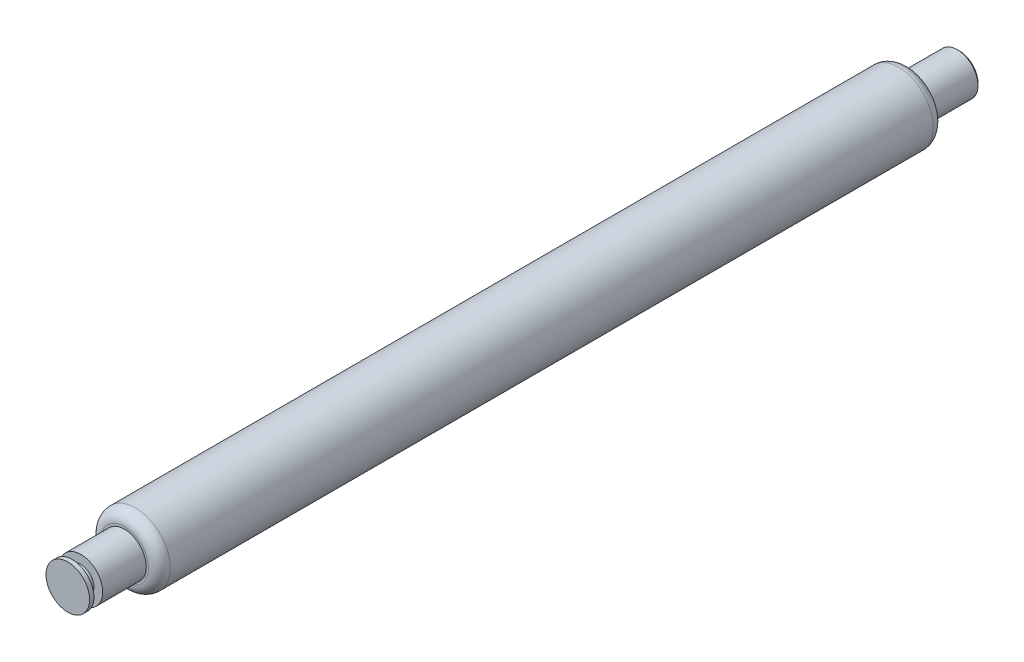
ISO-10303-21;
HEADER;
FILE_DESCRIPTION(('STEP AP214'),'2;1');
FILE_NAME('part.step','',(''),(''),'','','');
FILE_SCHEMA(('AUTOMOTIVE_DESIGN { 1 0 10303 214 1 1 1 1 }'));
ENDSEC;
DATA;
#1=APPLICATION_CONTEXT('core data for automotive mechanical design processes');
#2=APPLICATION_PROTOCOL_DEFINITION('international standard','automotive_design',2000,#1);
#3=PRODUCT_CONTEXT('',#1,'mechanical');
#4=PRODUCT('Part','Part','',(#3));
#5=PRODUCT_RELATED_PRODUCT_CATEGORY('part','',(#4));
#6=PRODUCT_DEFINITION_FORMATION('','',#4);
#7=PRODUCT_DEFINITION_CONTEXT('part definition',#1,'design');
#8=PRODUCT_DEFINITION('design','',#6,#7);
#9=PRODUCT_DEFINITION_SHAPE('','',#8);
#10=(LENGTH_UNIT() NAMED_UNIT(*) SI_UNIT(.MILLI.,.METRE.));
#11=(NAMED_UNIT(*) PLANE_ANGLE_UNIT() SI_UNIT($,.RADIAN.));
#12=(NAMED_UNIT(*) SI_UNIT($,.STERADIAN.) SOLID_ANGLE_UNIT());
#13=UNCERTAINTY_MEASURE_WITH_UNIT(LENGTH_MEASURE(1.E-05),#10,'distance_accuracy_value','');
#14=(GEOMETRIC_REPRESENTATION_CONTEXT(3) GLOBAL_UNCERTAINTY_ASSIGNED_CONTEXT((#13)) GLOBAL_UNIT_ASSIGNED_CONTEXT((#10,
#11,#12)) REPRESENTATION_CONTEXT('',''));
#15=CARTESIAN_POINT('',(0.,0.,0.));
#16=DIRECTION('',(0.,0.,1.));
#17=DIRECTION('',(1.,0.,0.));
#18=AXIS2_PLACEMENT_3D('',#15,#16,#17);
#19=CARTESIAN_POINT('',(0.,0.,180.));
#20=DIRECTION('',(0.,0.,-1.));
#21=DIRECTION('',(-1.,0.,0.));
#22=AXIS2_PLACEMENT_3D('',#19,#20,#21);
#23=CYLINDRICAL_SURFACE('',#22,8.);
#24=CARTESIAN_POINT('',(0.,0.,2.49999999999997));
#25=DIRECTION('',(0.,0.,1.));
#26=DIRECTION('',(1.,0.,0.));
#27=AXIS2_PLACEMENT_3D('',#24,#25,#26);
#28=CIRCLE('',#27,8.);
#29=CARTESIAN_POINT('',(-8.,0.,2.49999999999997));
#30=VERTEX_POINT('',#29);
#31=EDGE_CURVE('E60',#30,#30,#28,.T.);
#32=CARTESIAN_POINT('',(0.,0.,177.5));
#33=DIRECTION('',(0.,0.,1.));
#34=DIRECTION('',(1.,0.,0.));
#35=AXIS2_PLACEMENT_3D('',#32,#33,#34);
#36=CIRCLE('',#35,8.);
#37=CARTESIAN_POINT('',(-8.,0.,177.5));
#38=VERTEX_POINT('',#37);
#39=EDGE_CURVE('E63',#38,#38,#36,.F.);
#40=CARTESIAN_POINT('',(-8.,0.,2.49999999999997));
#41=CARTESIAN_POINT('',(-8.,0.,4.32291666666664));
#42=CARTESIAN_POINT('',(-8.,0.,6.14583333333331));
#43=CARTESIAN_POINT('',(-8.,0.,9.79166666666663));
#44=CARTESIAN_POINT('',(-8.,0.,11.6145833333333));
#45=CARTESIAN_POINT('',(-8.,0.,15.2604166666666));
#46=CARTESIAN_POINT('',(-8.,0.,17.0833333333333));
#47=CARTESIAN_POINT('',(-8.,0.,20.7291666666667));
#48=CARTESIAN_POINT('',(-8.,0.,22.5520833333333));
#49=CARTESIAN_POINT('',(-8.,0.,26.1979166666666));
#50=CARTESIAN_POINT('',(-8.,0.,28.0208333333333));
#51=CARTESIAN_POINT('',(-8.,0.,31.6666666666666));
#52=CARTESIAN_POINT('',(-8.,0.,33.4895833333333));
#53=CARTESIAN_POINT('',(-8.,0.,37.1354166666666));
#54=CARTESIAN_POINT('',(-8.,0.,38.9583333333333));
#55=CARTESIAN_POINT('',(-8.,0.,42.6041666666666));
#56=CARTESIAN_POINT('',(-8.,0.,44.4270833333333));
#57=CARTESIAN_POINT('',(-8.,0.,48.0729166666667));
#58=CARTESIAN_POINT('',(-8.,0.,49.8958333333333));
#59=CARTESIAN_POINT('',(-8.,0.,53.5416666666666));
#60=CARTESIAN_POINT('',(-8.,0.,55.3645833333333));
#61=CARTESIAN_POINT('',(-8.,0.,59.0104166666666));
#62=CARTESIAN_POINT('',(-8.,0.,60.8333333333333));
#63=CARTESIAN_POINT('',(-8.,0.,64.4791666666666));
#64=CARTESIAN_POINT('',(-8.,0.,66.3020833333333));
#65=CARTESIAN_POINT('',(-8.,0.,69.9479166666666));
#66=CARTESIAN_POINT('',(-8.,0.,71.7708333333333));
#67=CARTESIAN_POINT('',(-8.,0.,75.4166666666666));
#68=CARTESIAN_POINT('',(-8.,0.,77.2395833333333));
#69=CARTESIAN_POINT('',(-8.,0.,80.8854166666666));
#70=CARTESIAN_POINT('',(-8.,0.,82.7083333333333));
#71=CARTESIAN_POINT('',(-8.,0.,86.3541666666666));
#72=CARTESIAN_POINT('',(-8.,0.,88.1770833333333));
#73=CARTESIAN_POINT('',(-8.,0.,91.8229166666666));
#74=CARTESIAN_POINT('',(-8.,0.,93.6458333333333));
#75=CARTESIAN_POINT('',(-8.,0.,97.2916666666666));
#76=CARTESIAN_POINT('',(-8.,0.,99.1145833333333));
#77=CARTESIAN_POINT('',(-8.,0.,102.760416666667));
#78=CARTESIAN_POINT('',(-8.,0.,104.583333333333));
#79=CARTESIAN_POINT('',(-8.,0.,108.229166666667));
#80=CARTESIAN_POINT('',(-8.,0.,110.052083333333));
#81=CARTESIAN_POINT('',(-8.,0.,113.697916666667));
#82=CARTESIAN_POINT('',(-8.,0.,115.520833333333));
#83=CARTESIAN_POINT('',(-8.,0.,119.166666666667));
#84=CARTESIAN_POINT('',(-8.,0.,120.989583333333));
#85=CARTESIAN_POINT('',(-8.,0.,124.635416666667));
#86=CARTESIAN_POINT('',(-8.,0.,126.458333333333));
#87=CARTESIAN_POINT('',(-8.,0.,130.104166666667));
#88=CARTESIAN_POINT('',(-8.,0.,131.927083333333));
#89=CARTESIAN_POINT('',(-8.,0.,135.572916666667));
#90=CARTESIAN_POINT('',(-8.,0.,137.395833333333));
#91=CARTESIAN_POINT('',(-8.,0.,141.041666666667));
#92=CARTESIAN_POINT('',(-8.,0.,142.864583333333));
#93=CARTESIAN_POINT('',(-8.,0.,146.510416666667));
#94=CARTESIAN_POINT('',(-8.,0.,148.333333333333));
#95=CARTESIAN_POINT('',(-8.,0.,151.979166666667));
#96=CARTESIAN_POINT('',(-8.,0.,153.802083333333));
#97=CARTESIAN_POINT('',(-8.,0.,157.447916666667));
#98=CARTESIAN_POINT('',(-8.,0.,159.270833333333));
#99=CARTESIAN_POINT('',(-8.,0.,162.916666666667));
#100=CARTESIAN_POINT('',(-8.,0.,164.739583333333));
#101=CARTESIAN_POINT('',(-8.,0.,168.385416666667));
#102=CARTESIAN_POINT('',(-8.,0.,170.208333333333));
#103=CARTESIAN_POINT('',(-8.,0.,173.854166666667));
#104=CARTESIAN_POINT('',(-8.,0.,175.677083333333));
#105=CARTESIAN_POINT('',(-8.,0.,177.5));
#106=B_SPLINE_CURVE_WITH_KNOTS('',3,(#40,#41,#42,#43,#44,#45,#46,#47,#48,#49,#50,#51,#52,#53,
#54,#55,#56,#57,#58,#59,#60,#61,#62,#63,#64,#65,#66,#67,#68,#69,#70,#71,#72,#73,#74,#75,#76,#77,
#78,#79,#80,#81,#82,#83,#84,#85,#86,#87,#88,#89,#90,#91,#92,#93,#94,#95,#96,#97,#98,#99,#100,
#101,#102,#103,#104,#105),.UNSPECIFIED.,.F.,.F.,(4,2,2,2,2,2,2,2,2,2,2,2,2,2,2,2,2,2,2,2,2,2,2,
2,2,2,2,2,2,2,2,2,4),(0.,5.46874999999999,10.9375,16.40625,21.875,27.34375,32.8125,38.28125,
43.75,49.21875,54.6875,60.15625,65.625,71.09375,76.5625,82.03125,87.5,92.96875,98.4375,
103.90625,109.375,114.84375,120.3125,125.78125,131.25,136.71875,142.1875,147.65625,153.125,
158.59375,164.0625,169.53125,175.),.UNSPECIFIED.);
#107=EDGE_CURVE('BSEAM31',#30,#38,#106,.T.);
#108=ORIENTED_EDGE('',*,*,#31,.T.);
#109=ORIENTED_EDGE('',*,*,#39,.T.);
#110=ORIENTED_EDGE('',*,*,#107,.T.);
#111=ORIENTED_EDGE('',*,*,#107,.F.);
#112=EDGE_LOOP('',(#108,#110,#109,#111));
#113=FACE_BOUND('',#112,.T.);
#114=ADVANCED_FACE('F31',(#113),#23,.T.);
#115=CARTESIAN_POINT('',(0.,0.,180.));
#116=DIRECTION('',(0.,0.,1.));
#117=DIRECTION('',(1.,0.,0.));
#118=AXIS2_PLACEMENT_3D('',#115,#116,#117);
#119=PLANE('',#118);
#120=CARTESIAN_POINT('',(0.,0.,180.));
#121=DIRECTION('',(0.,0.,1.));
#122=DIRECTION('',(1.,0.,0.));
#123=AXIS2_PLACEMENT_3D('',#120,#121,#122);
#124=CIRCLE('',#123,5.);
#125=CARTESIAN_POINT('',(5.,0.,180.));
#126=VERTEX_POINT('',#125);
#127=EDGE_CURVE('E51',#126,#126,#124,.T.);
#128=ORIENTED_EDGE('',*,*,#127,.F.);
#129=EDGE_LOOP('',(#128));
#130=FACE_BOUND('',#129,.T.);
#131=CARTESIAN_POINT('',(0.,0.,180.));
#132=DIRECTION('',(0.,0.,1.));
#133=DIRECTION('',(1.,0.,0.));
#134=AXIS2_PLACEMENT_3D('',#131,#132,#133);
#135=CIRCLE('',#134,5.5);
#136=CARTESIAN_POINT('',(5.5,0.,180.));
#137=VERTEX_POINT('',#136);
#138=EDGE_CURVE('E54',#137,#137,#135,.T.);
#139=ORIENTED_EDGE('',*,*,#138,.T.);
#140=EDGE_LOOP('',(#139));
#141=FACE_BOUND('',#140,.T.);
#142=ADVANCED_FACE('F121',(#130,#141),#119,.T.);
#143=CARTESIAN_POINT('',(0.,0.,0.));
#144=DIRECTION('',(0.,0.,1.));
#145=DIRECTION('',(1.,0.,0.));
#146=AXIS2_PLACEMENT_3D('',#143,#144,#145);
#147=PLANE('',#146);
#148=CARTESIAN_POINT('',(0.,0.,0.));
#149=DIRECTION('',(0.,0.,1.));
#150=DIRECTION('',(1.,0.,0.));
#151=AXIS2_PLACEMENT_3D('',#148,#149,#150);
#152=CIRCLE('',#151,5.5);
#153=CARTESIAN_POINT('',(5.5,0.,0.));
#154=VERTEX_POINT('',#153);
#155=EDGE_CURVE('E57',#154,#154,#152,.F.);
#156=ORIENTED_EDGE('',*,*,#155,.T.);
#157=EDGE_LOOP('',(#156));
#158=FACE_BOUND('',#157,.T.);
#159=CARTESIAN_POINT('',(0.,0.,0.));
#160=DIRECTION('',(0.,0.,1.));
#161=DIRECTION('',(1.,0.,0.));
#162=AXIS2_PLACEMENT_3D('',#159,#160,#161);
#163=CIRCLE('',#162,4.75);
#164=CARTESIAN_POINT('',(4.75,0.,0.));
#165=VERTEX_POINT('',#164);
#166=EDGE_CURVE('E66',#165,#165,#163,.F.);
#167=ORIENTED_EDGE('',*,*,#166,.F.);
#168=EDGE_LOOP('',(#167));
#169=FACE_BOUND('',#168,.T.);
#170=ADVANCED_FACE('F127',(#158,#169),#147,.F.);
#171=CARTESIAN_POINT('',(0.,0.,-11.5));
#172=DIRECTION('',(0.,0.,1.));
#173=DIRECTION('',(1.,0.,0.));
#174=AXIS2_PLACEMENT_3D('',#171,#172,#173);
#175=CYLINDRICAL_SURFACE('',#174,4.75);
#176=CARTESIAN_POINT('',(0.,0.,-11.));
#177=DIRECTION('',(0.,0.,-1.));
#178=DIRECTION('',(-1.,0.,0.));
#179=AXIS2_PLACEMENT_3D('',#176,#177,#178);
#180=CIRCLE('',#179,4.75);
#181=CARTESIAN_POINT('',(-4.75,0.,-11.));
#182=VERTEX_POINT('',#181);
#183=EDGE_CURVE('E10',#182,#182,#180,.F.);
#184=ORIENTED_EDGE('',*,*,#183,.T.);
#185=EDGE_LOOP('',(#184));
#186=FACE_BOUND('',#185,.T.);
#187=ORIENTED_EDGE('',*,*,#166,.T.);
#188=EDGE_LOOP('',(#187));
#189=FACE_BOUND('',#188,.T.);
#190=ADVANCED_FACE('F164',(#186,#189),#175,.T.);
#191=CARTESIAN_POINT('',(0.,0.,-11.5));
#192=DIRECTION('',(0.,0.,-1.));
#193=DIRECTION('',(-1.,0.,0.));
#194=AXIS2_PLACEMENT_3D('',#191,#192,#193);
#195=PLANE('',#194);
#196=CARTESIAN_POINT('',(0.,0.,-11.5));
#197=DIRECTION('',(0.,0.,-1.));
#198=DIRECTION('',(-1.,0.,0.));
#199=AXIS2_PLACEMENT_3D('',#196,#197,#198);
#200=CIRCLE('',#199,3.50000000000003);
#201=CARTESIAN_POINT('',(-3.50000000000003,0.,-11.5));
#202=VERTEX_POINT('',#201);
#203=EDGE_CURVE('E38',#202,#202,#200,.F.);
#204=ORIENTED_EDGE('',*,*,#203,.T.);
#205=EDGE_LOOP('',(#204));
#206=FACE_BOUND('',#205,.T.);
#207=CARTESIAN_POINT('',(0.,0.,-11.5));
#208=DIRECTION('',(0.,0.,-1.));
#209=DIRECTION('',(-1.,0.,0.));
#210=AXIS2_PLACEMENT_3D('',#207,#208,#209);
#211=CIRCLE('',#210,4.24999999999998);
#212=CARTESIAN_POINT('',(-4.24999999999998,0.,-11.5));
#213=VERTEX_POINT('',#212);
#214=EDGE_CURVE('E42',#213,#213,#211,.T.);
#215=ORIENTED_EDGE('',*,*,#214,.T.);
#216=EDGE_LOOP('',(#215));
#217=FACE_BOUND('',#216,.T.);
#218=ADVANCED_FACE('F137',(#206,#217),#195,.T.);
#219=CARTESIAN_POINT('',(0.,0.,2.5));
#220=DIRECTION('',(0.,0.,1.));
#221=DIRECTION('',(1.,0.,0.));
#222=AXIS2_PLACEMENT_3D('',#219,#220,#221);
#223=TOROIDAL_SURFACE('',#222,5.5,2.5);
#224=ORIENTED_EDGE('',*,*,#155,.F.);
#225=EDGE_LOOP('',(#224));
#226=FACE_BOUND('',#225,.T.);
#227=ORIENTED_EDGE('',*,*,#31,.F.);
#228=EDGE_LOOP('',(#227));
#229=FACE_BOUND('',#228,.T.);
#230=ADVANCED_FACE('F133',(#226,#229),#223,.T.);
#231=CARTESIAN_POINT('',(0.,0.,177.5));
#232=DIRECTION('',(0.,0.,1.));
#233=DIRECTION('',(1.,0.,0.));
#234=AXIS2_PLACEMENT_3D('',#231,#232,#233);
#235=TOROIDAL_SURFACE('',#234,5.5,2.5);
#236=ORIENTED_EDGE('',*,*,#39,.F.);
#237=EDGE_LOOP('',(#236));
#238=FACE_BOUND('',#237,.T.);
#239=ORIENTED_EDGE('',*,*,#138,.F.);
#240=EDGE_LOOP('',(#239));
#241=FACE_BOUND('',#240,.T.);
#242=ADVANCED_FACE('F136',(#238,#241),#235,.T.);
#243=CARTESIAN_POINT('',(0.,0.,38.5));
#244=DIRECTION('',(0.,0.,-1.));
#245=DIRECTION('',(-1.,0.,0.));
#246=AXIS2_PLACEMENT_3D('',#243,#244,#245);
#247=CYLINDRICAL_SURFACE('',#246,3.);
#248=CARTESIAN_POINT('',(0.,0.,-11.));
#249=DIRECTION('',(0.,0.,-1.));
#250=DIRECTION('',(-1.,0.,0.));
#251=AXIS2_PLACEMENT_3D('',#248,#249,#250);
#252=CIRCLE('',#251,3.);
#253=CARTESIAN_POINT('',(-3.,0.,-11.));
#254=VERTEX_POINT('',#253);
#255=EDGE_CURVE('E46',#254,#254,#252,.T.);
#256=ORIENTED_EDGE('',*,*,#255,.T.);
#257=EDGE_LOOP('',(#256));
#258=FACE_BOUND('',#257,.T.);
#259=CARTESIAN_POINT('',(0.,0.,38.5));
#260=DIRECTION('',(0.,0.,-1.));
#261=DIRECTION('',(-1.,0.,0.));
#262=AXIS2_PLACEMENT_3D('',#259,#260,#261);
#263=CIRCLE('',#262,3.);
#264=CARTESIAN_POINT('',(-3.,0.,38.5));
#265=VERTEX_POINT('',#264);
#266=EDGE_CURVE('E69',#265,#265,#263,.T.);
#267=ORIENTED_EDGE('',*,*,#266,.F.);
#268=EDGE_LOOP('',(#267));
#269=FACE_BOUND('',#268,.T.);
#270=ADVANCED_FACE('F140',(#258,#269),#247,.F.);
#271=CARTESIAN_POINT('',(0.,0.,38.5));
#272=DIRECTION('',(0.,0.,-1.));
#273=DIRECTION('',(-1.,0.,0.));
#274=AXIS2_PLACEMENT_3D('',#271,#272,#273);
#275=CYLINDRICAL_SURFACE('',#274,5.);
#276=CARTESIAN_POINT('',(0.,0.,38.5));
#277=DIRECTION('',(0.,0.,-1.));
#278=DIRECTION('',(-1.,0.,0.));
#279=AXIS2_PLACEMENT_3D('',#276,#277,#278);
#280=CIRCLE('',#279,5.);
#281=CARTESIAN_POINT('',(-5.,0.,38.5));
#282=VERTEX_POINT('',#281);
#283=EDGE_CURVE('E76',#282,#282,#280,.T.);
#284=ORIENTED_EDGE('',*,*,#283,.T.);
#285=EDGE_LOOP('',(#284));
#286=FACE_BOUND('',#285,.T.);
#287=CARTESIAN_POINT('',(0.,0.,2.));
#288=DIRECTION('',(0.,0.,1.));
#289=DIRECTION('',(1.,0.,0.));
#290=AXIS2_PLACEMENT_3D('',#287,#288,#289);
#291=CIRCLE('',#290,5.);
#292=CARTESIAN_POINT('',(5.,0.,2.));
#293=VERTEX_POINT('',#292);
#294=EDGE_CURVE('E72',#293,#293,#291,.F.);
#295=ORIENTED_EDGE('',*,*,#294,.F.);
#296=EDGE_LOOP('',(#295));
#297=FACE_BOUND('',#296,.T.);
#298=ADVANCED_FACE('F146',(#286,#297),#275,.T.);
#299=CARTESIAN_POINT('',(0.,0.,180.));
#300=DIRECTION('',(0.,0.,-1.));
#301=DIRECTION('',(-1.,0.,0.));
#302=AXIS2_PLACEMENT_3D('',#299,#300,#301);
#303=CYLINDRICAL_SURFACE('',#302,6.);
#304=CARTESIAN_POINT('',(0.,0.,2.50000000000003));
#305=DIRECTION('',(0.,0.,-1.));
#306=DIRECTION('',(-1.,0.,0.));
#307=AXIS2_PLACEMENT_3D('',#304,#305,#306);
#308=CIRCLE('',#307,6.);
#309=CARTESIAN_POINT('',(-6.,0.,2.50000000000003));
#310=VERTEX_POINT('',#309);
#311=EDGE_CURVE('E86',#310,#310,#308,.F.);
#312=CARTESIAN_POINT('',(0.,0.,177.5));
#313=DIRECTION('',(0.,0.,-1.));
#314=DIRECTION('',(-1.,0.,0.));
#315=AXIS2_PLACEMENT_3D('',#312,#313,#314);
#316=CIRCLE('',#315,6.);
#317=CARTESIAN_POINT('',(-6.,0.,177.5));
#318=VERTEX_POINT('',#317);
#319=EDGE_CURVE('E79',#318,#318,#316,.T.);
#320=CARTESIAN_POINT('',(-6.,0.,2.50000000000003));
#321=CARTESIAN_POINT('',(-6.,0.,4.32291666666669));
#322=CARTESIAN_POINT('',(-6.,0.,6.14583333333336));
#323=CARTESIAN_POINT('',(-6.,0.,9.79166666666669));
#324=CARTESIAN_POINT('',(-6.,0.,11.6145833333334));
#325=CARTESIAN_POINT('',(-6.,0.,15.2604166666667));
#326=CARTESIAN_POINT('',(-6.,0.,17.0833333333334));
#327=CARTESIAN_POINT('',(-6.,0.,20.7291666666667));
#328=CARTESIAN_POINT('',(-6.,0.,22.5520833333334));
#329=CARTESIAN_POINT('',(-6.,0.,26.1979166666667));
#330=CARTESIAN_POINT('',(-6.,0.,28.0208333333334));
#331=CARTESIAN_POINT('',(-6.,0.,31.6666666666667));
#332=CARTESIAN_POINT('',(-6.,0.,33.4895833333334));
#333=CARTESIAN_POINT('',(-6.,0.,37.1354166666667));
#334=CARTESIAN_POINT('',(-6.,0.,38.9583333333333));
#335=CARTESIAN_POINT('',(-6.,0.,42.6041666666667));
#336=CARTESIAN_POINT('',(-6.,0.,44.4270833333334));
#337=CARTESIAN_POINT('',(-6.,0.,48.0729166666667));
#338=CARTESIAN_POINT('',(-6.,0.,49.8958333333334));
#339=CARTESIAN_POINT('',(-6.,0.,53.5416666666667));
#340=CARTESIAN_POINT('',(-6.,0.,55.3645833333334));
#341=CARTESIAN_POINT('',(-6.,0.,59.0104166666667));
#342=CARTESIAN_POINT('',(-6.,0.,60.8333333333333));
#343=CARTESIAN_POINT('',(-6.,0.,64.4791666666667));
#344=CARTESIAN_POINT('',(-6.,0.,66.3020833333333));
#345=CARTESIAN_POINT('',(-6.,0.,69.9479166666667));
#346=CARTESIAN_POINT('',(-6.,0.,71.7708333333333));
#347=CARTESIAN_POINT('',(-6.,0.,75.4166666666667));
#348=CARTESIAN_POINT('',(-6.,0.,77.2395833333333));
#349=CARTESIAN_POINT('',(-6.,0.,80.8854166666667));
#350=CARTESIAN_POINT('',(-6.,0.,82.7083333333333));
#351=CARTESIAN_POINT('',(-6.,0.,86.3541666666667));
#352=CARTESIAN_POINT('',(-6.,0.,88.1770833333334));
#353=CARTESIAN_POINT('',(-6.,0.,91.8229166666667));
#354=CARTESIAN_POINT('',(-6.,0.,93.6458333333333));
#355=CARTESIAN_POINT('',(-6.,0.,97.2916666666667));
#356=CARTESIAN_POINT('',(-6.,0.,99.1145833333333));
#357=CARTESIAN_POINT('',(-6.,0.,102.760416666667));
#358=CARTESIAN_POINT('',(-6.,0.,104.583333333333));
#359=CARTESIAN_POINT('',(-6.,0.,108.229166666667));
#360=CARTESIAN_POINT('',(-6.,0.,110.052083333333));
#361=CARTESIAN_POINT('',(-6.,0.,113.697916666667));
#362=CARTESIAN_POINT('',(-6.,0.,115.520833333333));
#363=CARTESIAN_POINT('',(-6.,0.,119.166666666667));
#364=CARTESIAN_POINT('',(-6.,0.,120.989583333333));
#365=CARTESIAN_POINT('',(-6.,0.,124.635416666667));
#366=CARTESIAN_POINT('',(-6.,0.,126.458333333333));
#367=CARTESIAN_POINT('',(-6.,0.,130.104166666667));
#368=CARTESIAN_POINT('',(-6.,0.,131.927083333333));
#369=CARTESIAN_POINT('',(-6.,0.,135.572916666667));
#370=CARTESIAN_POINT('',(-6.,0.,137.395833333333));
#371=CARTESIAN_POINT('',(-6.,0.,141.041666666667));
#372=CARTESIAN_POINT('',(-6.,0.,142.864583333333));
#373=CARTESIAN_POINT('',(-6.,0.,146.510416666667));
#374=CARTESIAN_POINT('',(-6.,0.,148.333333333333));
#375=CARTESIAN_POINT('',(-6.,0.,151.979166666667));
#376=CARTESIAN_POINT('',(-6.,0.,153.802083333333));
#377=CARTESIAN_POINT('',(-6.,0.,157.447916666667));
#378=CARTESIAN_POINT('',(-6.,0.,159.270833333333));
#379=CARTESIAN_POINT('',(-6.,0.,162.916666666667));
#380=CARTESIAN_POINT('',(-6.,0.,164.739583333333));
#381=CARTESIAN_POINT('',(-6.,0.,168.385416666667));
#382=CARTESIAN_POINT('',(-6.,0.,170.208333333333));
#383=CARTESIAN_POINT('',(-6.,0.,173.854166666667));
#384=CARTESIAN_POINT('',(-6.,0.,175.677083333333));
#385=CARTESIAN_POINT('',(-6.,0.,177.5));
#386=B_SPLINE_CURVE_WITH_KNOTS('',3,(#320,#321,#322,#323,#324,#325,#326,#327,#328,#329,#330,
#331,#332,#333,#334,#335,#336,#337,#338,#339,#340,#341,#342,#343,#344,#345,#346,#347,#348,#349,
#350,#351,#352,#353,#354,#355,#356,#357,#358,#359,#360,#361,#362,#363,#364,#365,#366,#367,#368,
#369,#370,#371,#372,#373,#374,#375,#376,#377,#378,#379,#380,#381,#382,#383,#384,#385),
.UNSPECIFIED.,.F.,.F.,(4,2,2,2,2,2,2,2,2,2,2,2,2,2,2,2,2,2,2,2,2,2,2,2,2,2,2,2,2,2,2,2,4),(0.,
5.46874999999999,10.9375,16.40625,21.875,27.34375,32.8125,38.28125,43.75,49.21875,54.6875,
60.15625,65.625,71.09375,76.5625,82.03125,87.5,92.96875,98.4375,103.90625,109.375,114.84375,
120.3125,125.78125,131.25,136.71875,142.1875,147.65625,153.125,158.59375,164.0625,169.53125,
175.),.UNSPECIFIED.);
#387=EDGE_CURVE('BSEAM157',#310,#318,#386,.T.);
#388=ORIENTED_EDGE('',*,*,#311,.F.);
#389=ORIENTED_EDGE('',*,*,#319,.F.);
#390=ORIENTED_EDGE('',*,*,#387,.T.);
#391=ORIENTED_EDGE('',*,*,#387,.F.);
#392=EDGE_LOOP('',(#388,#390,#389,#391));
#393=FACE_BOUND('',#392,.T.);
#394=ADVANCED_FACE('F157',(#393),#303,.F.);
#395=CARTESIAN_POINT('',(0.,0.,178.));
#396=DIRECTION('',(0.,0.,1.));
#397=DIRECTION('',(1.,0.,0.));
#398=AXIS2_PLACEMENT_3D('',#395,#396,#397);
#399=PLANE('',#398);
#400=CARTESIAN_POINT('',(0.,0.,178.));
#401=DIRECTION('',(0.,0.,1.));
#402=DIRECTION('',(1.,0.,0.));
#403=AXIS2_PLACEMENT_3D('',#400,#401,#402);
#404=CIRCLE('',#403,5.5);
#405=CARTESIAN_POINT('',(5.5,0.,178.));
#406=VERTEX_POINT('',#405);
#407=EDGE_CURVE('E75',#406,#406,#404,.T.);
#408=ORIENTED_EDGE('',*,*,#407,.F.);
#409=EDGE_LOOP('',(#408));
#410=FACE_BOUND('',#409,.T.);
#411=ADVANCED_FACE('F216',(#410),#399,.F.);
#412=CARTESIAN_POINT('',(0.,0.,2.));
#413=DIRECTION('',(0.,0.,1.));
#414=DIRECTION('',(1.,0.,0.));
#415=AXIS2_PLACEMENT_3D('',#412,#413,#414);
#416=PLANE('',#415);
#417=ORIENTED_EDGE('',*,*,#294,.T.);
#418=EDGE_LOOP('',(#417));
#419=FACE_BOUND('',#418,.T.);
#420=CARTESIAN_POINT('',(0.,0.,2.));
#421=DIRECTION('',(0.,0.,1.));
#422=DIRECTION('',(1.,0.,0.));
#423=AXIS2_PLACEMENT_3D('',#420,#421,#422);
#424=CIRCLE('',#423,5.5);
#425=CARTESIAN_POINT('',(5.5,0.,2.));
#426=VERTEX_POINT('',#425);
#427=EDGE_CURVE('E83',#426,#426,#424,.F.);
#428=ORIENTED_EDGE('',*,*,#427,.F.);
#429=EDGE_LOOP('',(#428));
#430=FACE_BOUND('',#429,.T.);
#431=ADVANCED_FACE('F227',(#419,#430),#416,.T.);
#432=CARTESIAN_POINT('',(0.,0.,2.5));
#433=DIRECTION('',(0.,0.,1.));
#434=DIRECTION('',(1.,0.,0.));
#435=AXIS2_PLACEMENT_3D('',#432,#433,#434);
#436=TOROIDAL_SURFACE('',#435,5.5,0.5);
#437=ORIENTED_EDGE('',*,*,#427,.T.);
#438=EDGE_LOOP('',(#437));
#439=FACE_BOUND('',#438,.T.);
#440=ORIENTED_EDGE('',*,*,#311,.T.);
#441=EDGE_LOOP('',(#440));
#442=FACE_BOUND('',#441,.T.);
#443=ADVANCED_FACE('F237',(#439,#442),#436,.F.);
#444=CARTESIAN_POINT('',(0.,0.,177.5));
#445=DIRECTION('',(0.,0.,1.));
#446=DIRECTION('',(1.,0.,0.));
#447=AXIS2_PLACEMENT_3D('',#444,#445,#446);
#448=TOROIDAL_SURFACE('',#447,5.5,0.5);
#449=ORIENTED_EDGE('',*,*,#319,.T.);
#450=EDGE_LOOP('',(#449));
#451=FACE_BOUND('',#450,.T.);
#452=ORIENTED_EDGE('',*,*,#407,.T.);
#453=EDGE_LOOP('',(#452));
#454=FACE_BOUND('',#453,.T.);
#455=ADVANCED_FACE('F247',(#451,#454),#448,.F.);
#456=CARTESIAN_POINT('',(0.,0.,38.5));
#457=DIRECTION('',(0.,0.,-1.));
#458=DIRECTION('',(-1.,0.,0.));
#459=AXIS2_PLACEMENT_3D('',#456,#457,#458);
#460=PLANE('',#459);
#461=ORIENTED_EDGE('',*,*,#266,.T.);
#462=EDGE_LOOP('',(#461));
#463=FACE_BOUND('',#462,.T.);
#464=ORIENTED_EDGE('',*,*,#283,.F.);
#465=EDGE_LOOP('',(#464));
#466=FACE_BOUND('',#465,.T.);
#467=ADVANCED_FACE('F256',(#463,#466),#460,.F.);
#468=CARTESIAN_POINT('',(0.,0.,180.));
#469=DIRECTION('',(0.,0.,-1.));
#470=DIRECTION('',(-1.,0.,0.));
#471=AXIS2_PLACEMENT_3D('',#468,#469,#470);
#472=CYLINDRICAL_SURFACE('',#471,5.);
#473=CARTESIAN_POINT('',(0.,0.,190.));
#474=DIRECTION('',(0.,0.,-1.));
#475=DIRECTION('',(-1.,0.,0.));
#476=AXIS2_PLACEMENT_3D('',#473,#474,#475);
#477=CIRCLE('',#476,5.);
#478=CARTESIAN_POINT('',(-5.,0.,190.));
#479=VERTEX_POINT('',#478);
#480=EDGE_CURVE('E80',#479,#479,#477,.T.);
#481=ORIENTED_EDGE('',*,*,#480,.T.);
#482=EDGE_LOOP('',(#481));
#483=FACE_BOUND('',#482,.T.);
#484=ORIENTED_EDGE('',*,*,#127,.T.);
#485=EDGE_LOOP('',(#484));
#486=FACE_BOUND('',#485,.T.);
#487=ADVANCED_FACE('F263',(#483,#486),#472,.T.);
#488=CARTESIAN_POINT('',(0.,5.,190.));
#489=DIRECTION('',(0.,0.,1.));
#490=DIRECTION('',(1.,0.,0.));
#491=AXIS2_PLACEMENT_3D('',#488,#489,#490);
#492=PLANE('',#491);
#493=CARTESIAN_POINT('',(0.,0.,190.));
#494=DIRECTION('',(0.,0.,-1.));
#495=DIRECTION('',(-1.,0.,0.));
#496=AXIS2_PLACEMENT_3D('',#493,#494,#495);
#497=CIRCLE('',#496,3.);
#498=CARTESIAN_POINT('',(-3.,0.,190.));
#499=VERTEX_POINT('',#498);
#500=EDGE_CURVE('E93',#499,#499,#497,.T.);
#501=ORIENTED_EDGE('',*,*,#500,.T.);
#502=EDGE_LOOP('',(#501));
#503=FACE_BOUND('',#502,.T.);
#504=ORIENTED_EDGE('',*,*,#480,.F.);
#505=EDGE_LOOP('',(#504));
#506=FACE_BOUND('',#505,.T.);
#507=ADVANCED_FACE('F278',(#503,#506),#492,.T.);
#508=CARTESIAN_POINT('',(0.,0.,180.));
#509=DIRECTION('',(0.,0.,-1.));
#510=DIRECTION('',(-1.,0.,0.));
#511=AXIS2_PLACEMENT_3D('',#508,#509,#510);
#512=CYLINDRICAL_SURFACE('',#511,3.);
#513=CARTESIAN_POINT('',(0.,0.,192.));
#514=DIRECTION('',(0.,0.,-1.));
#515=DIRECTION('',(-1.,0.,0.));
#516=AXIS2_PLACEMENT_3D('',#513,#514,#515);
#517=CIRCLE('',#516,3.);
#518=CARTESIAN_POINT('',(-3.,0.,192.));
#519=VERTEX_POINT('',#518);
#520=EDGE_CURVE('E96',#519,#519,#517,.T.);
#521=ORIENTED_EDGE('',*,*,#520,.T.);
#522=EDGE_LOOP('',(#521));
#523=FACE_BOUND('',#522,.T.);
#524=ORIENTED_EDGE('',*,*,#500,.F.);
#525=EDGE_LOOP('',(#524));
#526=FACE_BOUND('',#525,.T.);
#527=ADVANCED_FACE('F288',(#523,#526),#512,.T.);
#528=CARTESIAN_POINT('',(0.,3.,192.));
#529=DIRECTION('',(0.,0.,-1.));
#530=DIRECTION('',(-1.,0.,0.));
#531=AXIS2_PLACEMENT_3D('',#528,#529,#530);
#532=PLANE('',#531);
#533=CARTESIAN_POINT('',(0.,0.,192.));
#534=DIRECTION('',(0.,0.,-1.));
#535=DIRECTION('',(-1.,0.,0.));
#536=AXIS2_PLACEMENT_3D('',#533,#534,#535);
#537=CIRCLE('',#536,5.);
#538=CARTESIAN_POINT('',(-5.,0.,192.));
#539=VERTEX_POINT('',#538);
#540=EDGE_CURVE('E99',#539,#539,#537,.T.);
#541=ORIENTED_EDGE('',*,*,#540,.T.);
#542=EDGE_LOOP('',(#541));
#543=FACE_BOUND('',#542,.T.);
#544=ORIENTED_EDGE('',*,*,#520,.F.);
#545=EDGE_LOOP('',(#544));
#546=FACE_BOUND('',#545,.T.);
#547=ADVANCED_FACE('F118',(#543,#546),#532,.T.);
#548=CARTESIAN_POINT('',(0.,0.,180.));
#549=DIRECTION('',(0.,0.,-1.));
#550=DIRECTION('',(-1.,0.,0.));
#551=AXIS2_PLACEMENT_3D('',#548,#549,#550);
#552=CYLINDRICAL_SURFACE('',#551,5.);
#553=CARTESIAN_POINT('',(0.,0.,193.));
#554=DIRECTION('',(0.,0.,-1.));
#555=DIRECTION('',(-1.,0.,0.));
#556=AXIS2_PLACEMENT_3D('',#553,#554,#555);
#557=CIRCLE('',#556,5.);
#558=CARTESIAN_POINT('',(-5.,0.,193.));
#559=VERTEX_POINT('',#558);
#560=EDGE_CURVE('E102',#559,#559,#557,.T.);
#561=ORIENTED_EDGE('',*,*,#560,.T.);
#562=EDGE_LOOP('',(#561));
#563=FACE_BOUND('',#562,.T.);
#564=ORIENTED_EDGE('',*,*,#540,.F.);
#565=EDGE_LOOP('',(#564));
#566=FACE_BOUND('',#565,.T.);
#567=ADVANCED_FACE('F106',(#563,#566),#552,.T.);
#568=CARTESIAN_POINT('',(0.,5.,193.));
#569=DIRECTION('',(0.,0.,1.));
#570=DIRECTION('',(1.,0.,0.));
#571=AXIS2_PLACEMENT_3D('',#568,#569,#570);
#572=PLANE('',#571);
#573=ORIENTED_EDGE('',*,*,#560,.F.);
#574=EDGE_LOOP('',(#573));
#575=FACE_BOUND('',#574,.T.);
#576=ADVANCED_FACE('F109',(#575),#572,.T.);
#577=CARTESIAN_POINT('',(0.,0.,-11.));
#578=DIRECTION('',(0.,0.,-1.));
#579=DIRECTION('',(-1.,0.,0.));
#580=AXIS2_PLACEMENT_3D('',#577,#578,#579);
#581=CONICAL_SURFACE('',#580,3.,0.785398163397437);
#582=ORIENTED_EDGE('',*,*,#203,.F.);
#583=EDGE_LOOP('',(#582));
#584=FACE_BOUND('',#583,.T.);
#585=ORIENTED_EDGE('',*,*,#255,.F.);
#586=EDGE_LOOP('',(#585));
#587=FACE_BOUND('',#586,.T.);
#588=ADVANCED_FACE('F111',(#584,#587),#581,.F.);
#589=CARTESIAN_POINT('',(0.,0.,-11.5));
#590=DIRECTION('',(0.,0.,1.));
#591=DIRECTION('',(1.,0.,0.));
#592=AXIS2_PLACEMENT_3D('',#589,#590,#591);
#593=CONICAL_SURFACE('',#592,4.24999999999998,0.785398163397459);
#594=ORIENTED_EDGE('',*,*,#183,.F.);
#595=EDGE_LOOP('',(#594));
#596=FACE_BOUND('',#595,.T.);
#597=ORIENTED_EDGE('',*,*,#214,.F.);
#598=EDGE_LOOP('',(#597));
#599=FACE_BOUND('',#598,.T.);
#600=ADVANCED_FACE('F33',(#596,#599),#593,.T.);
#601=CLOSED_SHELL('',(#114,#142,#170,#190,#218,#230,#242,#270,#298,#394,#411,#431,#443,#455,
#467,#487,#507,#527,#547,#567,#576,#588,#600));
#602=MANIFOLD_SOLID_BREP('B2',#601);
#603=ADVANCED_BREP_SHAPE_REPRESENTATION('',(#18,#602),#14);
#604=SHAPE_DEFINITION_REPRESENTATION(#9,#603);
ENDSEC;
END-ISO-10303-21;
